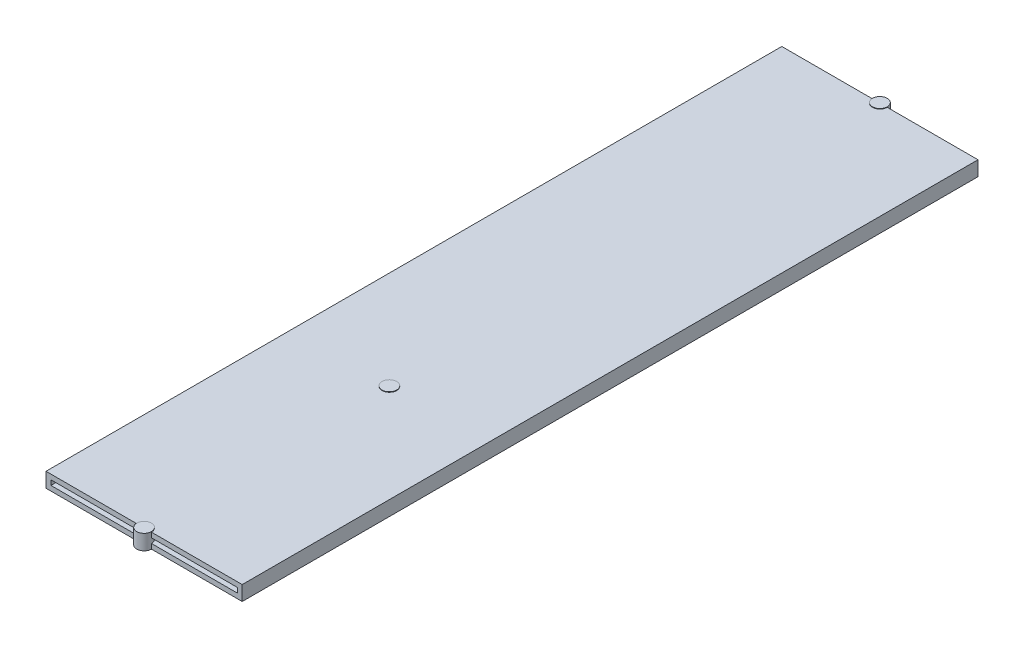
from build123d import *

# Parameters (mm, degrees)
BOSS_EXTRU_1_DEPTH      = 500
BOSS_EXTRU_1_DEPTH_BACK = 1000
ESQUISSE1_W             = 400
ESQUISSE1_H             = 30
ESQUISSE1_W_2           = 380
ESQUISSE1_H_2           = 10
BOSS_EXTRU_2_DEPTH      = 16
BOSS_EXTRU_2_DEPTH_BACK = 15
ESQUISSE2_R             = 15


with BuildPart() as part:
    # Esquisse1 → Boss.-Extru.1 (new, two sides: drawn at the far end of the back side and taken through both)
    with BuildSketch(Plane.XY.offset(-BOSS_EXTRU_1_DEPTH_BACK)):
        Rectangle(ESQUISSE1_W, ESQUISSE1_H)
        Rectangle(ESQUISSE1_W_2, ESQUISSE1_H_2, mode=Mode.SUBTRACT)
    extrude(amount=BOSS_EXTRU_1_DEPTH + BOSS_EXTRU_1_DEPTH_BACK)

    # Esquisse2 → Boss.-Extru.2 (add, two sides: drawn at the far end of the back side and taken through both)
    with BuildSketch(Plane(origin=(0, 0, 0), x_dir=(1, 0, 0), z_dir=(0, 1, 0)).offset(-BOSS_EXTRU_2_DEPTH_BACK)):
        with Locations(Location((0, -500, 0), (0, 0, 270))):
            Circle(ESQUISSE2_R)
        with Locations(Location((0, 0, 0), (0, 0, 270))):
            Circle(ESQUISSE2_R)
        with Locations(Location((0, 1000, 0), (0, 0, 270))):
            Circle(ESQUISSE2_R)
    extrude(amount=BOSS_EXTRU_2_DEPTH + BOSS_EXTRU_2_DEPTH_BACK)


solid = part.part
